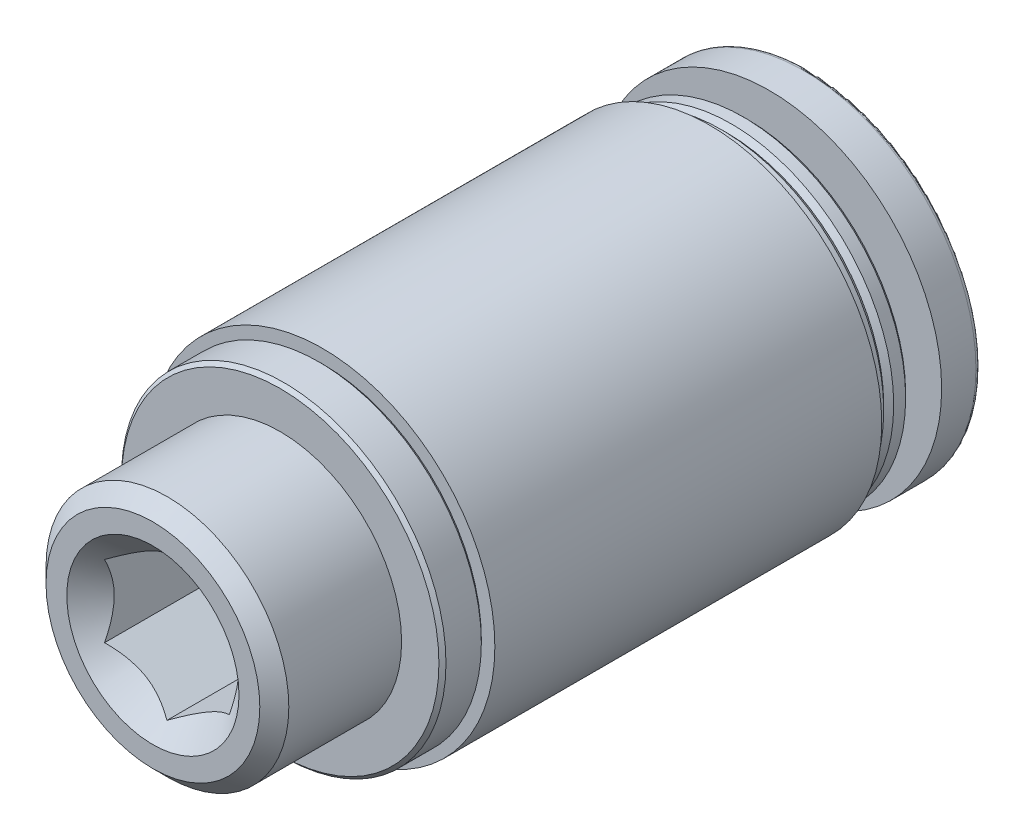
from build123d import *

# Parameters (mm, degrees)
LINEAR_AUSTRAGEN1_DEPTH = 8.5


with BuildPart() as part:
    # Skizze1 → Rotation1 (revolve)
    with BuildSketch(Plane(origin=(0, 0, 0), x_dir=(0, 0, -1), z_dir=(1, 0, 0)), mode=Mode.PRIVATE) as rotation1_sk:
        with BuildLine():
            Line((1.7, 0), (1.7, 6.9))
            Line((1.7, 6.9), (17.2, 6.9))
            Line((17.2, 6.9), (17.2, 6.5))
            Line((17.2, 6.5), (17.679289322, 6.5))
            Line((17.679289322, 6.5), (17.879289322, 6.3))
            Line((17.879289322, 6.3), (18.079289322, 6.5))
            Line((18.079289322, 6.5), (18.558578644, 6.5))
            Line((18.558578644, 6.5), (18.7, 6.358578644))
            Line((18.7, 6.358578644), (18.7, 4.7))
            Line((18.7, 4.7), (19.225, 4.7))
            ThreePointArc((19.225, 4.7), (19.490165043, 4.809834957), (19.6, 5.075))
            Line((19.6, 5.075), (19.6, 6.9))
            Line((19.6, 6.9), (20.973729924, 6.9))
            ThreePointArc((20.973729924, 6.9), (21.102287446, 6.853208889), (21.170691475, 6.734729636))
            Line((21.170691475, 6.734729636), (21.6, 4.3))
            Line((21.6, 4.3), (21.6, 0))
            Line((21.6, 0), (1.7, 0))
        make_face()
    revolve(rotation1_sk.sketch.rotate(Axis((0, 0, -21.6), (0, 0, 1)), 270), axis=Axis((0, 0, -21.6), (0, 0, 1)))

    # Skizze2 → Rotation2 (revolve)
    with BuildSketch(Plane(origin=(0, 0, 0), x_dir=(0, 0, -1), z_dir=(1, 0, 0)), mode=Mode.PRIVATE) as rotation2_sk:
        Polygon((-5.1, 0), (-5.1, 4.283), (-4.519, 4.864), (0, 4.864), (0, 6.358578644), (0.141421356, 6.5), (1.558578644, 6.5), (1.7, 6.358578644), (1.7, 0), align=None)
    revolve(rotation2_sk.sketch.rotate(Axis((0, 0, -1.7), (0, 0, 1)), 270), axis=Axis((0, 0, -1.7), (0, 0, 1)))

    # Skizze3 → Schnitt-Rotation1 (revolve, cut)
    with BuildSketch(Plane(origin=(0, 0, 0), x_dir=(0, 0, -1), z_dir=(1, 0, 0)), mode=Mode.PRIVATE) as schnitt_rotation1_sk:
        with BuildLine():
            Line((-5.1, 0), (-5.1, 3.45))
            Line((-5.1, 3.45), (-4, 2.35))
            Line((-4, 2.35), (3.4, 2.35))
            Line((3.4, 2.35), (3.4, 4))
            Line((3.4, 4), (21.3, 4))
            ThreePointArc((21.3, 4), (21.512132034, 4.087867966), (21.6, 4.3))
            Line((21.6, 4.3), (21.6, 0))
            Line((21.6, 0), (-5.1, 0))
        make_face()
    revolve(schnitt_rotation1_sk.sketch.rotate(Axis((0, 0, -21.6), (0, 0, 1)), 270), axis=Axis((0, 0, -21.6), (0, 0, 1)), mode=Mode.SUBTRACT)

    # Skizze4 → Linear austragen1 (cut)
    with BuildSketch(Plane.XY.offset(5.1)):
        Polygon((-2.5, 1.443375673), (-2.5, -1.443375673), (0, -2.886751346), (2.5, -1.443375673), (2.5, 1.443375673), (0, 2.886751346), align=None)
    extrude(amount=-LINEAR_AUSTRAGEN1_DEPTH, mode=Mode.SUBTRACT)


solid = part.part
